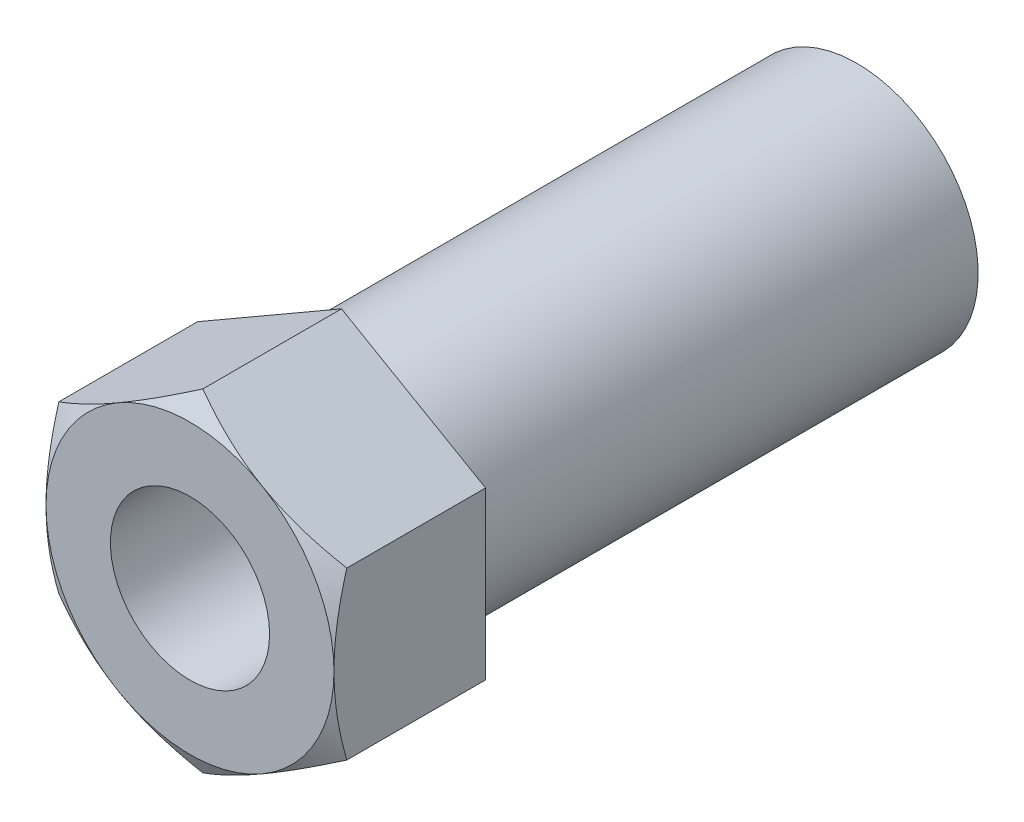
ISO-10303-21;
HEADER;
FILE_DESCRIPTION(('STEP AP214'),'2;1');
FILE_NAME('part.step','',(''),(''),'','','');
FILE_SCHEMA(('AUTOMOTIVE_DESIGN { 1 0 10303 214 1 1 1 1 }'));
ENDSEC;
DATA;
#1=APPLICATION_CONTEXT('core data for automotive mechanical design processes');
#2=APPLICATION_PROTOCOL_DEFINITION('international standard','automotive_design',2000,#1);
#3=PRODUCT_CONTEXT('',#1,'mechanical');
#4=PRODUCT('Part','Part','',(#3));
#5=PRODUCT_RELATED_PRODUCT_CATEGORY('part','',(#4));
#6=PRODUCT_DEFINITION_FORMATION('','',#4);
#7=PRODUCT_DEFINITION_CONTEXT('part definition',#1,'design');
#8=PRODUCT_DEFINITION('design','',#6,#7);
#9=PRODUCT_DEFINITION_SHAPE('','',#8);
#10=(LENGTH_UNIT() NAMED_UNIT(*) SI_UNIT(.MILLI.,.METRE.));
#11=(NAMED_UNIT(*) PLANE_ANGLE_UNIT() SI_UNIT($,.RADIAN.));
#12=(NAMED_UNIT(*) SI_UNIT($,.STERADIAN.) SOLID_ANGLE_UNIT());
#13=UNCERTAINTY_MEASURE_WITH_UNIT(LENGTH_MEASURE(1.E-05),#10,'distance_accuracy_value','');
#14=(GEOMETRIC_REPRESENTATION_CONTEXT(3) GLOBAL_UNCERTAINTY_ASSIGNED_CONTEXT((#13)) GLOBAL_UNIT_ASSIGNED_CONTEXT((#10,
#11,#12)) REPRESENTATION_CONTEXT('',''));
#15=CARTESIAN_POINT('',(0.,0.,0.));
#16=DIRECTION('',(0.,0.,1.));
#17=DIRECTION('',(1.,0.,0.));
#18=AXIS2_PLACEMENT_3D('',#15,#16,#17);
#19=CARTESIAN_POINT('',(9.5,5.48482755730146,-44.));
#20=DIRECTION('',(0.5,0.866025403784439,0.));
#21=DIRECTION('',(-0.866025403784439,0.5,0.));
#22=AXIS2_PLACEMENT_3D('',#19,#20,#21);
#23=PLANE('',#22);
#24=DIRECTION('',(0.,0.,1.));
#25=VECTOR('',#24,1.);
#26=CARTESIAN_POINT('',(9.5,5.48482755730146,-44.));
#27=LINE('',#26,#25);
#28=CARTESIAN_POINT('',(9.5,5.48482755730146,-9.99999999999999));
#29=VERTEX_POINT('',#28);
#30=CARTESIAN_POINT('',(9.5,5.48482755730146,-0.848505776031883));
#31=VERTEX_POINT('',#30);
#32=EDGE_CURVE('E429',#29,#31,#27,.T.);
#33=ORIENTED_EDGE('',*,*,#32,.F.);
#34=DIRECTION('',(-0.866025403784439,0.5,0.));
#35=VECTOR('',#34,1.);
#36=CARTESIAN_POINT('',(9.5,5.48482755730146,-9.99999999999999));
#37=LINE('',#36,#35);
#38=CARTESIAN_POINT('',(0.,10.9696551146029,-9.99999999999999));
#39=VERTEX_POINT('',#38);
#40=EDGE_CURVE('E418',#29,#39,#37,.T.);
#41=ORIENTED_EDGE('',*,*,#40,.T.);
#42=DIRECTION('',(0.,0.,1.));
#43=VECTOR('',#42,1.);
#44=CARTESIAN_POINT('',(0.,10.9696551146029,-44.));
#45=LINE('',#44,#43);
#46=CARTESIAN_POINT('',(0.,10.9696551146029,-0.848505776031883));
#47=VERTEX_POINT('',#46);
#48=EDGE_CURVE('E426',#39,#47,#45,.T.);
#49=ORIENTED_EDGE('',*,*,#48,.T.);
#50=CARTESIAN_POINT('',(9.5002,5.48471208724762,-0.848572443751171));
#51=CARTESIAN_POINT('',(9.2913692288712,5.60528058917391,-0.778973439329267));
#52=CARTESIAN_POINT('',(9.08175982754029,5.72629863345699,-0.712533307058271));
#53=CARTESIAN_POINT('',(8.66086011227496,5.96930519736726,-0.586847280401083));
#54=CARTESIAN_POINT('',(8.44956926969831,6.09129402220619,-0.527603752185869));
#55=CARTESIAN_POINT('',(7.81229220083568,6.45922610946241,-0.361814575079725));
#56=CARTESIAN_POINT('',(7.38379023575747,6.7066218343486,-0.267514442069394));
#57=CARTESIAN_POINT('',(6.74255666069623,7.07683821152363,-0.156938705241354));
#58=CARTESIAN_POINT('',(6.53174078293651,7.19855281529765,-0.125439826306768));
#59=CARTESIAN_POINT('',(6.10913296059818,7.44254555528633,-0.0726182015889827));
#60=CARTESIAN_POINT('',(5.89734099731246,7.56482370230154,-0.0512956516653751));
#61=CARTESIAN_POINT('',(5.47340378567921,7.8095839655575,-0.0193730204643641));
#62=CARTESIAN_POINT('',(5.26125925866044,7.93206566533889,-0.00876019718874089));
#63=CARTESIAN_POINT('',(4.83677424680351,8.17714220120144,0.00151746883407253));
#64=CARTESIAN_POINT('',(4.62443376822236,8.29973703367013,0.0011826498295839));
#65=CARTESIAN_POINT('',(4.22745800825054,8.52893109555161,-0.00967336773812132));
#66=CARTESIAN_POINT('',(4.04279470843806,8.63554650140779,-0.0188702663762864));
#67=CARTESIAN_POINT('',(3.67389999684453,8.84852796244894,-0.0453653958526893));
#68=CARTESIAN_POINT('',(3.48966861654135,8.95489399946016,-0.0626641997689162));
#69=CARTESIAN_POINT('',(2.937688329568,9.2735799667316,-0.126304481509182));
#70=CARTESIAN_POINT('',(2.57091646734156,9.48533580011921,-0.184381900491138));
#71=CARTESIAN_POINT('',(1.83348217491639,9.91109368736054,-0.329576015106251));
#72=CARTESIAN_POINT('',(1.46291385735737,10.1250414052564,-0.417308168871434));
#73=CARTESIAN_POINT('',(0.72730328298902,10.5497463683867,-0.616423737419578));
#74=CARTESIAN_POINT('',(0.362251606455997,10.7605090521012,-0.727760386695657));
#75=CARTESIAN_POINT('',(-0.000199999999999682,10.9697705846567,-0.84857244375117));
#76=B_SPLINE_CURVE_WITH_KNOTS('',3,(#50,#51,#52,#53,#54,#55,#56,#57,#58,#59,#60,#61,#62,#63,#64,
#65,#66,#67,#68,#69,#70,#71,#72,#73,#74,#75),.UNSPECIFIED.,.F.,.F.,(4,2,2,2,2,2,2,2,2,2,2,2,4),
(0.,0.752880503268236,1.50600787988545,3.0154687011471,3.75167336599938,4.48789219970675,
5.22323407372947,5.95855322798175,6.59868084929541,7.23885375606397,8.52010929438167,
9.82978009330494,11.1368800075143),.UNSPECIFIED.);
#77=CARTESIAN_POINT('',(4.75,8.22724133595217,0.));
#78=VERTEX_POINT('',#77);
#79=EDGE_CURVE('E537',#78,#47,#76,.T.);
#80=ORIENTED_EDGE('',*,*,#79,.F.);
#81=EDGE_CURVE('E483',#31,#78,#76,.T.);
#82=ORIENTED_EDGE('',*,*,#81,.F.);
#83=EDGE_LOOP('',(#33,#41,#49,#80,#82));
#84=FACE_BOUND('',#83,.T.);
#85=ADVANCED_FACE('F348',(#84),#23,.T.);
#86=CARTESIAN_POINT('',(9.5,-5.48482755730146,-44.));
#87=DIRECTION('',(1.,0.,0.));
#88=DIRECTION('',(0.,0.,-1.));
#89=AXIS2_PLACEMENT_3D('',#86,#87,#88);
#90=PLANE('',#89);
#91=DIRECTION('',(0.,0.,1.));
#92=VECTOR('',#91,1.);
#93=CARTESIAN_POINT('',(9.5,-5.48482755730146,-44.));
#94=LINE('',#93,#92);
#95=CARTESIAN_POINT('',(9.5,-5.48482755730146,-9.99999999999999));
#96=VERTEX_POINT('',#95);
#97=CARTESIAN_POINT('',(9.5,-5.48482755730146,-0.848505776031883));
#98=VERTEX_POINT('',#97);
#99=EDGE_CURVE('E457',#96,#98,#94,.T.);
#100=ORIENTED_EDGE('',*,*,#99,.F.);
#101=DIRECTION('',(0.,1.,0.));
#102=VECTOR('',#101,1.);
#103=CARTESIAN_POINT('',(9.5,-5.48482755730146,-9.99999999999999));
#104=LINE('',#103,#102);
#105=EDGE_CURVE('E431',#96,#29,#104,.T.);
#106=ORIENTED_EDGE('',*,*,#105,.T.);
#107=ORIENTED_EDGE('',*,*,#32,.T.);
#108=CARTESIAN_POINT('',(9.5,-14.8119713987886,-4.67464251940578));
#109=CARTESIAN_POINT('',(9.5,-14.6040441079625,-4.57359549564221));
#110=CARTESIAN_POINT('',(9.5,-14.3958747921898,-4.47304672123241));
#111=CARTESIAN_POINT('',(9.5,-13.9790016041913,-4.27305844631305));
#112=CARTESIAN_POINT('',(9.5,-13.7702977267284,-4.17361895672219));
#113=CARTESIAN_POINT('',(9.5,-13.1432537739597,-3.8771077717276));
#114=CARTESIAN_POINT('',(9.5,-12.724041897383,-3.68187285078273));
#115=CARTESIAN_POINT('',(9.5,-11.8805959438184,-3.29643571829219));
#116=CARTESIAN_POINT('',(9.5,-11.45634700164,-3.10626595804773));
#117=CARTESIAN_POINT('',(9.5,-10.6044998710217,-2.73360960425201));
#118=CARTESIAN_POINT('',(9.5,-10.1769018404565,-2.55112265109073));
#119=CARTESIAN_POINT('',(9.5,-9.30413897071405,-2.19026779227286));
#120=CARTESIAN_POINT('',(9.5,-8.85884497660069,-2.01221056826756));
#121=CARTESIAN_POINT('',(9.5,-7.96307952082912,-1.66938163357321));
#122=CARTESIAN_POINT('',(9.5,-7.51260748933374,-1.5046114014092));
#123=CARTESIAN_POINT('',(9.5,-6.60657855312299,-1.19262064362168));
#124=CARTESIAN_POINT('',(9.5,-6.15103372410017,-1.0453654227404));
#125=CARTESIAN_POINT('',(9.5,-5.23342980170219,-0.773073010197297));
#126=CARTESIAN_POINT('',(9.5,-4.77137278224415,-0.648028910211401));
#127=CARTESIAN_POINT('',(9.5,-3.84270558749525,-0.426710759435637));
#128=CARTESIAN_POINT('',(9.5,-3.37613026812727,-0.330294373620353));
#129=CARTESIAN_POINT('',(9.5,-2.67195905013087,-0.21133762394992));
#130=CARTESIAN_POINT('',(9.5,-2.43650215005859,-0.175961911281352));
#131=CARTESIAN_POINT('',(9.5,-1.96439237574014,-0.114458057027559));
#132=CARTESIAN_POINT('',(9.5,-1.72773962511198,-0.0883289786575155));
#133=CARTESIAN_POINT('',(9.5,-1.2566706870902,-0.0461697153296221));
#134=CARTESIAN_POINT('',(9.5,-1.02226603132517,-0.0300112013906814));
#135=CARTESIAN_POINT('',(9.5,-0.552983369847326,-0.00762536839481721));
#136=CARTESIAN_POINT('',(9.5,-0.318105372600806,-0.00139787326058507));
#137=CARTESIAN_POINT('',(9.5,0.151710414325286,0.000977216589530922));
#138=CARTESIAN_POINT('',(9.5,0.386648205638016,-0.00287550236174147));
#139=CARTESIAN_POINT('',(9.5,0.856154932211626,-0.0205666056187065));
#140=CARTESIAN_POINT('',(9.5,1.0907238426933,-0.0344056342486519));
#141=CARTESIAN_POINT('',(9.5,1.65160690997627,-0.0791404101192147));
#142=CARTESIAN_POINT('',(9.5,1.9775624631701,-0.114614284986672));
#143=CARTESIAN_POINT('',(9.5,2.6271547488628,-0.202941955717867));
#144=CARTESIAN_POINT('',(9.5,2.9507908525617,-0.255800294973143));
#145=CARTESIAN_POINT('',(9.5,3.59541240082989,-0.377026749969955));
#146=CARTESIAN_POINT('',(9.5,3.91639525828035,-0.445408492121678));
#147=CARTESIAN_POINT('',(9.5,4.55514687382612,-0.595584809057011));
#148=CARTESIAN_POINT('',(9.5,4.87291592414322,-0.677378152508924));
#149=CARTESIAN_POINT('',(9.5,5.51320285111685,-0.854585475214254));
#150=CARTESIAN_POINT('',(9.5,5.83563984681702,-0.950289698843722));
#151=CARTESIAN_POINT('',(9.5,6.47714039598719,-1.15171100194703));
#152=CARTESIAN_POINT('',(9.5,6.79620583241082,-1.25742212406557));
#153=CARTESIAN_POINT('',(9.5,7.43140263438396,-1.47723890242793));
#154=CARTESIAN_POINT('',(9.5,7.74753414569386,-1.59134413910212));
#155=CARTESIAN_POINT('',(9.5,8.21977674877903,-1.76776624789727));
#156=CARTESIAN_POINT('',(9.5,8.3768771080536,-1.82745575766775));
#157=CARTESIAN_POINT('',(9.5,8.69045766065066,-1.94844118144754));
#158=CARTESIAN_POINT('',(9.5,8.84693785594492,-2.00973709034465));
#159=CARTESIAN_POINT('',(9.5,9.37238948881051,-2.21841310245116));
#160=CARTESIAN_POINT('',(9.5,9.74002809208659,-2.36915607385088));
#161=CARTESIAN_POINT('',(9.5,10.4725140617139,-2.67729383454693));
#162=CARTESIAN_POINT('',(9.5,10.8373612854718,-2.83468896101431));
#163=CARTESIAN_POINT('',(9.5,11.5647155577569,-3.1549507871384));
#164=CARTESIAN_POINT('',(9.5,11.9272221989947,-3.31781841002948));
#165=CARTESIAN_POINT('',(9.5,12.6501853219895,-3.64804951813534));
#166=CARTESIAN_POINT('',(9.5,13.0106417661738,-3.81541308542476));
#167=CARTESIAN_POINT('',(9.5,13.7300101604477,-4.15397846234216));
#168=CARTESIAN_POINT('',(9.5,14.0889210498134,-4.32518252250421));
#169=CARTESIAN_POINT('',(9.5,14.8052288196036,-4.67073186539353));
#170=CARTESIAN_POINT('',(9.5,15.1626256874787,-4.84507717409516));
#171=CARTESIAN_POINT('',(9.5,16.2327933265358,-5.37203331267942));
#172=CARTESIAN_POINT('',(9.5,16.943616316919,-5.72860000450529));
#173=CARTESIAN_POINT('',(9.5,18.3630405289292,-6.45025108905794));
#174=CARTESIAN_POINT('',(9.5,19.0716324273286,-6.81535374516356));
#175=CARTESIAN_POINT('',(9.5,20.4858204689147,-7.55134236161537));
#176=CARTESIAN_POINT('',(9.5,21.1914165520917,-7.9222284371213));
#177=CARTESIAN_POINT('',(9.5,22.5999984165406,-8.66828108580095));
#178=CARTESIAN_POINT('',(9.5,23.3029850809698,-9.0434459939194));
#179=CARTESIAN_POINT('',(9.5,24.7070954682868,-9.79723174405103));
#180=CARTESIAN_POINT('',(9.5,25.4082192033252,-10.1758525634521));
#181=CARTESIAN_POINT('',(9.5,27.3043063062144,-11.2045618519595));
#182=CARTESIAN_POINT('',(9.5,28.4978494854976,-11.8572669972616));
#183=CARTESIAN_POINT('',(9.5,30.8820105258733,-13.1682987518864));
#184=CARTESIAN_POINT('',(9.5,32.0726280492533,-13.8266259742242));
#185=CARTESIAN_POINT('',(9.5,34.4465595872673,-15.1445181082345));
#186=CARTESIAN_POINT('',(9.5,35.6298831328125,-15.8040658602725));
#187=CARTESIAN_POINT('',(9.5,37.4035349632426,-16.7956031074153));
#188=CARTESIAN_POINT('',(9.5,37.9944943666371,-17.1264647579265));
#189=CARTESIAN_POINT('',(9.5,39.1760411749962,-17.7888506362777));
#190=CARTESIAN_POINT('',(9.5,39.766628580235,-18.1203748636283));
#191=CARTESIAN_POINT('',(9.5,40.3570547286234,-18.452186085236));
#192=B_SPLINE_CURVE_WITH_KNOTS('',3,(#108,#109,#110,#111,#112,#113,#114,#115,#116,#117,#118,
#119,#120,#121,#122,#123,#124,#125,#126,#127,#128,#129,#130,#131,#132,#133,#134,#135,#136,#137,
#138,#139,#140,#141,#142,#143,#144,#145,#146,#147,#148,#149,#150,#151,#152,#153,#154,#155,#156,
#157,#158,#159,#160,#161,#162,#163,#164,#165,#166,#167,#168,#169,#170,#171,#172,#173,#174,#175,
#176,#177,#178,#179,#180,#181,#182,#183,#184,#185,#186,#187,#188,#189,#190,#191),.UNSPECIFIED.,
.F.,.F.,(4,2,2,2,2,2,2,2,2,2,2,2,2,2,2,2,2,2,2,2,2,2,2,2,2,2,2,2,2,2,2,2,2,2,2,2,2,2,2,2,2,4),
(0.,0.693539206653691,1.38708523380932,2.77437924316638,4.16908323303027,5.56372186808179,
7.0022790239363,8.44099603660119,9.8768138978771,11.3121843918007,12.7402939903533,
13.4544396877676,14.1685130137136,14.8731927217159,15.5778599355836,16.2825490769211,
16.9872836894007,17.9703836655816,18.9537407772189,19.9379644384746,20.922097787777,
21.9309222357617,22.9391498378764,23.9473270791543,24.4514927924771,24.9556569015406,
26.1475951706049,27.339593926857,28.5317947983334,29.7240174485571,30.9169580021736,
32.1099084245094,34.4955596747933,36.8868926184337,39.278273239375,41.6687530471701,
44.0592172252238,48.1402621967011,52.2217579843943,56.285902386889,58.3177293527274,
60.3495548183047),.UNSPECIFIED.);
#193=CARTESIAN_POINT('',(9.5,0.,0.));
#194=VERTEX_POINT('',#193);
#195=EDGE_CURVE('E489',#194,#31,#192,.T.);
#196=ORIENTED_EDGE('',*,*,#195,.F.);
#197=EDGE_CURVE('E491',#98,#194,#192,.T.);
#198=ORIENTED_EDGE('',*,*,#197,.F.);
#199=EDGE_LOOP('',(#100,#106,#107,#196,#198));
#200=FACE_BOUND('',#199,.T.);
#201=ADVANCED_FACE('F508',(#200),#90,.T.);
#202=CARTESIAN_POINT('',(9.5,-5.48482755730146,-44.));
#203=DIRECTION('',(0.5,-0.866025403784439,0.));
#204=DIRECTION('',(0.866025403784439,0.5,0.));
#205=AXIS2_PLACEMENT_3D('',#202,#203,#204);
#206=PLANE('',#205);
#207=DIRECTION('',(0.,0.,1.));
#208=VECTOR('',#207,1.);
#209=CARTESIAN_POINT('',(0.,-10.9696551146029,-44.));
#210=LINE('',#209,#208);
#211=CARTESIAN_POINT('',(0.,-10.9696551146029,-9.99999999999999));
#212=VERTEX_POINT('',#211);
#213=CARTESIAN_POINT('',(0.,-10.9696551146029,-0.848505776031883));
#214=VERTEX_POINT('',#213);
#215=EDGE_CURVE('E462',#212,#214,#210,.T.);
#216=ORIENTED_EDGE('',*,*,#215,.F.);
#217=DIRECTION('',(0.866025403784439,0.5,0.));
#218=VECTOR('',#217,1.);
#219=CARTESIAN_POINT('',(9.5,-5.48482755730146,-9.99999999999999));
#220=LINE('',#219,#218);
#221=EDGE_CURVE('E551',#212,#96,#220,.T.);
#222=ORIENTED_EDGE('',*,*,#221,.T.);
#223=ORIENTED_EDGE('',*,*,#99,.T.);
#224=CARTESIAN_POINT('',(-0.0002,-10.9697705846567,-0.848572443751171));
#225=CARTESIAN_POINT('',(0.2086307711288,-10.8492020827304,-0.778973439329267));
#226=CARTESIAN_POINT('',(0.418240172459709,-10.7281840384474,-0.712533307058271));
#227=CARTESIAN_POINT('',(0.839139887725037,-10.4851774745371,-0.586847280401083));
#228=CARTESIAN_POINT('',(1.05043073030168,-10.3631886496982,-0.527603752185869));
#229=CARTESIAN_POINT('',(1.68770779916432,-9.99525656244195,-0.361814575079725));
#230=CARTESIAN_POINT('',(2.11620976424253,-9.74786083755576,-0.267514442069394));
#231=CARTESIAN_POINT('',(2.75744333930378,-9.37764446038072,-0.156938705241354));
#232=CARTESIAN_POINT('',(2.96825921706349,-9.25592985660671,-0.125439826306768));
#233=CARTESIAN_POINT('',(3.39086703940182,-9.01193711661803,-0.0726182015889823));
#234=CARTESIAN_POINT('',(3.60265900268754,-8.88965896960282,-0.0512956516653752));
#235=CARTESIAN_POINT('',(4.0265962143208,-8.64489870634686,-0.0193730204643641));
#236=CARTESIAN_POINT('',(4.23874074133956,-8.52241700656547,-0.00876019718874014));
#237=CARTESIAN_POINT('',(4.66322575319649,-8.27734047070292,0.00151746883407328));
#238=CARTESIAN_POINT('',(4.87556623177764,-8.15474563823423,0.00118264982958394));
#239=CARTESIAN_POINT('',(5.27254199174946,-7.92555157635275,-0.00967336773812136));
#240=CARTESIAN_POINT('',(5.45720529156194,-7.81893617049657,-0.018870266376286));
#241=CARTESIAN_POINT('',(5.82610000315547,-7.60595470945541,-0.045365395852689));
#242=CARTESIAN_POINT('',(6.01033138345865,-7.4995886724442,-0.0626641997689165));
#243=CARTESIAN_POINT('',(6.56231167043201,-7.18090270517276,-0.126304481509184));
#244=CARTESIAN_POINT('',(6.92908353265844,-6.96914687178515,-0.184381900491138));
#245=CARTESIAN_POINT('',(7.66651782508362,-6.54338898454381,-0.329576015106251));
#246=CARTESIAN_POINT('',(8.03708614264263,-6.32944126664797,-0.417308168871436));
#247=CARTESIAN_POINT('',(8.77269671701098,-5.90473630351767,-0.616423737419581));
#248=CARTESIAN_POINT('',(9.13774839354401,-5.6939736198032,-0.727760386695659));
#249=CARTESIAN_POINT('',(9.5002,-5.48471208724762,-0.84857244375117));
#250=B_SPLINE_CURVE_WITH_KNOTS('',3,(#224,#225,#226,#227,#228,#229,#230,#231,#232,#233,#234,
#235,#236,#237,#238,#239,#240,#241,#242,#243,#244,#245,#246,#247,#248,#249),.UNSPECIFIED.,.F.,
.F.,(4,2,2,2,2,2,2,2,2,2,2,2,4),(0.,0.752880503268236,1.50600787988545,3.0154687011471,
3.75167336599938,4.48789219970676,5.22323407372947,5.95855322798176,6.59868084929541,
7.23885375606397,8.52010929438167,9.82978009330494,11.1368800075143),.UNSPECIFIED.);
#251=CARTESIAN_POINT('',(4.75,-8.22724133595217,0.));
#252=VERTEX_POINT('',#251);
#253=EDGE_CURVE('E443',#252,#98,#250,.T.);
#254=ORIENTED_EDGE('',*,*,#253,.F.);
#255=EDGE_CURVE('E439',#214,#252,#250,.T.);
#256=ORIENTED_EDGE('',*,*,#255,.F.);
#257=EDGE_LOOP('',(#216,#222,#223,#254,#256));
#258=FACE_BOUND('',#257,.T.);
#259=ADVANCED_FACE('F577',(#258),#206,.T.);
#260=CARTESIAN_POINT('',(-9.5,-5.48482755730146,-44.));
#261=DIRECTION('',(-0.5,-0.866025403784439,0.));
#262=DIRECTION('',(0.866025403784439,-0.5,0.));
#263=AXIS2_PLACEMENT_3D('',#260,#261,#262);
#264=PLANE('',#263);
#265=DIRECTION('',(0.,0.,1.));
#266=VECTOR('',#265,1.);
#267=CARTESIAN_POINT('',(-9.5,-5.48482755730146,-44.));
#268=LINE('',#267,#266);
#269=CARTESIAN_POINT('',(-9.5,-5.48482755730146,-9.99999999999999));
#270=VERTEX_POINT('',#269);
#271=CARTESIAN_POINT('',(-9.5,-5.48482755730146,-0.848505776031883));
#272=VERTEX_POINT('',#271);
#273=EDGE_CURVE('E441',#270,#272,#268,.T.);
#274=ORIENTED_EDGE('',*,*,#273,.F.);
#275=DIRECTION('',(0.866025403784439,-0.5,0.));
#276=VECTOR('',#275,1.);
#277=CARTESIAN_POINT('',(-9.5,-5.48482755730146,-9.99999999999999));
#278=LINE('',#277,#276);
#279=EDGE_CURVE('E554',#270,#212,#278,.T.);
#280=ORIENTED_EDGE('',*,*,#279,.T.);
#281=ORIENTED_EDGE('',*,*,#215,.T.);
#282=CARTESIAN_POINT('',(-9.5002,-5.48471208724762,-0.848572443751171));
#283=CARTESIAN_POINT('',(-9.2913692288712,-5.60528058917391,-0.778973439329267));
#284=CARTESIAN_POINT('',(-9.08175982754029,-5.72629863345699,-0.712533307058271));
#285=CARTESIAN_POINT('',(-8.66086011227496,-5.96930519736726,-0.586847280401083));
#286=CARTESIAN_POINT('',(-8.44956926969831,-6.09129402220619,-0.527603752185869));
#287=CARTESIAN_POINT('',(-7.81229220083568,-6.45922610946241,-0.361814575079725));
#288=CARTESIAN_POINT('',(-7.38379023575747,-6.7066218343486,-0.267514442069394));
#289=CARTESIAN_POINT('',(-6.74255666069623,-7.07683821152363,-0.156938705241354));
#290=CARTESIAN_POINT('',(-6.53174078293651,-7.19855281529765,-0.125439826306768));
#291=CARTESIAN_POINT('',(-6.10913296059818,-7.44254555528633,-0.0726182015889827));
#292=CARTESIAN_POINT('',(-5.89734099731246,-7.56482370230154,-0.0512956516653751));
#293=CARTESIAN_POINT('',(-5.47340378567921,-7.8095839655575,-0.0193730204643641));
#294=CARTESIAN_POINT('',(-5.26125925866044,-7.93206566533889,-0.00876019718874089));
#295=CARTESIAN_POINT('',(-4.83677424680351,-8.17714220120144,0.00151746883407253));
#296=CARTESIAN_POINT('',(-4.62443376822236,-8.29973703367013,0.0011826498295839));
#297=CARTESIAN_POINT('',(-4.22745800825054,-8.52893109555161,-0.00967336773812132));
#298=CARTESIAN_POINT('',(-4.04279470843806,-8.63554650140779,-0.0188702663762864));
#299=CARTESIAN_POINT('',(-3.67389999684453,-8.84852796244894,-0.0453653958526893));
#300=CARTESIAN_POINT('',(-3.48966861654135,-8.95489399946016,-0.0626641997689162));
#301=CARTESIAN_POINT('',(-2.937688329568,-9.2735799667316,-0.126304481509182));
#302=CARTESIAN_POINT('',(-2.57091646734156,-9.48533580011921,-0.184381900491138));
#303=CARTESIAN_POINT('',(-1.83348217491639,-9.91109368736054,-0.329576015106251));
#304=CARTESIAN_POINT('',(-1.46291385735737,-10.1250414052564,-0.417308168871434));
#305=CARTESIAN_POINT('',(-0.72730328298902,-10.5497463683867,-0.616423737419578));
#306=CARTESIAN_POINT('',(-0.362251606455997,-10.7605090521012,-0.727760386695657));
#307=CARTESIAN_POINT('',(0.000199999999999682,-10.9697705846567,-0.84857244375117));
#308=B_SPLINE_CURVE_WITH_KNOTS('',3,(#282,#283,#284,#285,#286,#287,#288,#289,#290,#291,#292,
#293,#294,#295,#296,#297,#298,#299,#300,#301,#302,#303,#304,#305,#306,#307),.UNSPECIFIED.,.F.,
.F.,(4,2,2,2,2,2,2,2,2,2,2,2,4),(0.,0.752880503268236,1.50600787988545,3.0154687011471,
3.75167336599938,4.48789219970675,5.22323407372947,5.95855322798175,6.59868084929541,
7.23885375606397,8.52010929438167,9.82978009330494,11.1368800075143),.UNSPECIFIED.);
#309=CARTESIAN_POINT('',(-4.75,-8.22724133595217,0.));
#310=VERTEX_POINT('',#309);
#311=EDGE_CURVE('E488',#310,#214,#308,.T.);
#312=ORIENTED_EDGE('',*,*,#311,.F.);
#313=EDGE_CURVE('E481',#272,#310,#308,.T.);
#314=ORIENTED_EDGE('',*,*,#313,.F.);
#315=EDGE_LOOP('',(#274,#280,#281,#312,#314));
#316=FACE_BOUND('',#315,.T.);
#317=ADVANCED_FACE('F486',(#316),#264,.T.);
#318=CARTESIAN_POINT('',(-9.5,-5.48482755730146,-44.));
#319=DIRECTION('',(-1.,0.,0.));
#320=DIRECTION('',(0.,0.,1.));
#321=AXIS2_PLACEMENT_3D('',#318,#319,#320);
#322=PLANE('',#321);
#323=DIRECTION('',(0.,0.,1.));
#324=VECTOR('',#323,1.);
#325=CARTESIAN_POINT('',(-9.5,5.48482755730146,-44.));
#326=LINE('',#325,#324);
#327=CARTESIAN_POINT('',(-9.5,5.48482755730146,-9.99999999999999));
#328=VERTEX_POINT('',#327);
#329=CARTESIAN_POINT('',(-9.5,5.48482755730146,-0.848505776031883));
#330=VERTEX_POINT('',#329);
#331=EDGE_CURVE('E438',#328,#330,#326,.T.);
#332=ORIENTED_EDGE('',*,*,#331,.F.);
#333=DIRECTION('',(0.,-1.,0.));
#334=VECTOR('',#333,1.);
#335=CARTESIAN_POINT('',(-9.5,-5.48482755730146,-9.99999999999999));
#336=LINE('',#335,#334);
#337=EDGE_CURVE('E363',#328,#270,#336,.T.);
#338=ORIENTED_EDGE('',*,*,#337,.T.);
#339=ORIENTED_EDGE('',*,*,#273,.T.);
#340=CARTESIAN_POINT('',(-9.5,-14.8119713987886,-4.67464251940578));
#341=CARTESIAN_POINT('',(-9.5,-14.6040441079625,-4.57359549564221));
#342=CARTESIAN_POINT('',(-9.5,-14.3958747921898,-4.47304672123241));
#343=CARTESIAN_POINT('',(-9.5,-13.9790016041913,-4.27305844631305));
#344=CARTESIAN_POINT('',(-9.5,-13.7702977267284,-4.17361895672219));
#345=CARTESIAN_POINT('',(-9.5,-13.1432537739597,-3.8771077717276));
#346=CARTESIAN_POINT('',(-9.5,-12.724041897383,-3.68187285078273));
#347=CARTESIAN_POINT('',(-9.5,-11.8805959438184,-3.29643571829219));
#348=CARTESIAN_POINT('',(-9.5,-11.45634700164,-3.10626595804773));
#349=CARTESIAN_POINT('',(-9.5,-10.6044998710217,-2.73360960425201));
#350=CARTESIAN_POINT('',(-9.5,-10.1769018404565,-2.55112265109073));
#351=CARTESIAN_POINT('',(-9.5,-9.30413897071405,-2.19026779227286));
#352=CARTESIAN_POINT('',(-9.5,-8.85884497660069,-2.01221056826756));
#353=CARTESIAN_POINT('',(-9.5,-7.96307952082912,-1.66938163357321));
#354=CARTESIAN_POINT('',(-9.5,-7.51260748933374,-1.5046114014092));
#355=CARTESIAN_POINT('',(-9.5,-6.60657855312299,-1.19262064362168));
#356=CARTESIAN_POINT('',(-9.5,-6.15103372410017,-1.0453654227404));
#357=CARTESIAN_POINT('',(-9.5,-5.23342980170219,-0.773073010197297));
#358=CARTESIAN_POINT('',(-9.5,-4.77137278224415,-0.648028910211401));
#359=CARTESIAN_POINT('',(-9.5,-3.84270558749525,-0.426710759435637));
#360=CARTESIAN_POINT('',(-9.5,-3.37613026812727,-0.330294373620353));
#361=CARTESIAN_POINT('',(-9.5,-2.67195905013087,-0.21133762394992));
#362=CARTESIAN_POINT('',(-9.5,-2.43650215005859,-0.175961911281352));
#363=CARTESIAN_POINT('',(-9.5,-1.96439237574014,-0.114458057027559));
#364=CARTESIAN_POINT('',(-9.5,-1.72773962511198,-0.0883289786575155));
#365=CARTESIAN_POINT('',(-9.5,-1.2566706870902,-0.0461697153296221));
#366=CARTESIAN_POINT('',(-9.5,-1.02226603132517,-0.0300112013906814));
#367=CARTESIAN_POINT('',(-9.5,-0.552983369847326,-0.00762536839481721));
#368=CARTESIAN_POINT('',(-9.5,-0.318105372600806,-0.00139787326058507));
#369=CARTESIAN_POINT('',(-9.5,0.151710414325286,0.000977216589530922));
#370=CARTESIAN_POINT('',(-9.5,0.386648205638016,-0.00287550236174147));
#371=CARTESIAN_POINT('',(-9.5,0.856154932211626,-0.0205666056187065));
#372=CARTESIAN_POINT('',(-9.5,1.0907238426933,-0.0344056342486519));
#373=CARTESIAN_POINT('',(-9.5,1.65160690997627,-0.0791404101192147));
#374=CARTESIAN_POINT('',(-9.5,1.9775624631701,-0.114614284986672));
#375=CARTESIAN_POINT('',(-9.5,2.6271547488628,-0.202941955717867));
#376=CARTESIAN_POINT('',(-9.5,2.9507908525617,-0.255800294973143));
#377=CARTESIAN_POINT('',(-9.5,3.59541240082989,-0.377026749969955));
#378=CARTESIAN_POINT('',(-9.5,3.91639525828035,-0.445408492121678));
#379=CARTESIAN_POINT('',(-9.5,4.55514687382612,-0.595584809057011));
#380=CARTESIAN_POINT('',(-9.5,4.87291592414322,-0.677378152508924));
#381=CARTESIAN_POINT('',(-9.5,5.51320285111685,-0.854585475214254));
#382=CARTESIAN_POINT('',(-9.5,5.83563984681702,-0.950289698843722));
#383=CARTESIAN_POINT('',(-9.5,6.47714039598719,-1.15171100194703));
#384=CARTESIAN_POINT('',(-9.5,6.79620583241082,-1.25742212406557));
#385=CARTESIAN_POINT('',(-9.5,7.43140263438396,-1.47723890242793));
#386=CARTESIAN_POINT('',(-9.5,7.74753414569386,-1.59134413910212));
#387=CARTESIAN_POINT('',(-9.5,8.21977674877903,-1.76776624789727));
#388=CARTESIAN_POINT('',(-9.5,8.3768771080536,-1.82745575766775));
#389=CARTESIAN_POINT('',(-9.5,8.69045766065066,-1.94844118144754));
#390=CARTESIAN_POINT('',(-9.5,8.84693785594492,-2.00973709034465));
#391=CARTESIAN_POINT('',(-9.5,9.37238948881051,-2.21841310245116));
#392=CARTESIAN_POINT('',(-9.5,9.74002809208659,-2.36915607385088));
#393=CARTESIAN_POINT('',(-9.5,10.4725140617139,-2.67729383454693));
#394=CARTESIAN_POINT('',(-9.5,10.8373612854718,-2.83468896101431));
#395=CARTESIAN_POINT('',(-9.5,11.5647155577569,-3.1549507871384));
#396=CARTESIAN_POINT('',(-9.5,11.9272221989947,-3.31781841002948));
#397=CARTESIAN_POINT('',(-9.5,12.6501853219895,-3.64804951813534));
#398=CARTESIAN_POINT('',(-9.5,13.0106417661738,-3.81541308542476));
#399=CARTESIAN_POINT('',(-9.5,13.7300101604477,-4.15397846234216));
#400=CARTESIAN_POINT('',(-9.5,14.0889210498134,-4.32518252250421));
#401=CARTESIAN_POINT('',(-9.5,14.8052288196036,-4.67073186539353));
#402=CARTESIAN_POINT('',(-9.5,15.1626256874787,-4.84507717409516));
#403=CARTESIAN_POINT('',(-9.5,16.2327933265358,-5.37203331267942));
#404=CARTESIAN_POINT('',(-9.5,16.943616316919,-5.72860000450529));
#405=CARTESIAN_POINT('',(-9.5,18.3630405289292,-6.45025108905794));
#406=CARTESIAN_POINT('',(-9.5,19.0716324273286,-6.81535374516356));
#407=CARTESIAN_POINT('',(-9.5,20.4858204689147,-7.55134236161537));
#408=CARTESIAN_POINT('',(-9.5,21.1914165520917,-7.9222284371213));
#409=CARTESIAN_POINT('',(-9.5,22.5999984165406,-8.66828108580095));
#410=CARTESIAN_POINT('',(-9.5,23.3029850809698,-9.0434459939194));
#411=CARTESIAN_POINT('',(-9.5,24.7070954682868,-9.79723174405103));
#412=CARTESIAN_POINT('',(-9.5,25.4082192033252,-10.1758525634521));
#413=CARTESIAN_POINT('',(-9.5,27.3043063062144,-11.2045618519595));
#414=CARTESIAN_POINT('',(-9.5,28.4978494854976,-11.8572669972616));
#415=CARTESIAN_POINT('',(-9.5,30.8820105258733,-13.1682987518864));
#416=CARTESIAN_POINT('',(-9.5,32.0726280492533,-13.8266259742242));
#417=CARTESIAN_POINT('',(-9.5,34.4465595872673,-15.1445181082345));
#418=CARTESIAN_POINT('',(-9.5,35.6298831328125,-15.8040658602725));
#419=CARTESIAN_POINT('',(-9.5,37.4035349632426,-16.7956031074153));
#420=CARTESIAN_POINT('',(-9.5,37.9944943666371,-17.1264647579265));
#421=CARTESIAN_POINT('',(-9.5,39.1760411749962,-17.7888506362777));
#422=CARTESIAN_POINT('',(-9.5,39.766628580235,-18.1203748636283));
#423=CARTESIAN_POINT('',(-9.5,40.3570547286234,-18.452186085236));
#424=B_SPLINE_CURVE_WITH_KNOTS('',3,(#340,#341,#342,#343,#344,#345,#346,#347,#348,#349,#350,
#351,#352,#353,#354,#355,#356,#357,#358,#359,#360,#361,#362,#363,#364,#365,#366,#367,#368,#369,
#370,#371,#372,#373,#374,#375,#376,#377,#378,#379,#380,#381,#382,#383,#384,#385,#386,#387,#388,
#389,#390,#391,#392,#393,#394,#395,#396,#397,#398,#399,#400,#401,#402,#403,#404,#405,#406,#407,
#408,#409,#410,#411,#412,#413,#414,#415,#416,#417,#418,#419,#420,#421,#422,#423),.UNSPECIFIED.,
.F.,.F.,(4,2,2,2,2,2,2,2,2,2,2,2,2,2,2,2,2,2,2,2,2,2,2,2,2,2,2,2,2,2,2,2,2,2,2,2,2,2,2,2,2,4),
(0.,0.693539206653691,1.38708523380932,2.77437924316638,4.16908323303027,5.56372186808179,
7.0022790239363,8.44099603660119,9.8768138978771,11.3121843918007,12.7402939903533,
13.4544396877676,14.1685130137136,14.8731927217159,15.5778599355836,16.2825490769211,
16.9872836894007,17.9703836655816,18.9537407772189,19.9379644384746,20.922097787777,
21.9309222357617,22.9391498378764,23.9473270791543,24.4514927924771,24.9556569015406,
26.1475951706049,27.339593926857,28.5317947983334,29.7240174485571,30.9169580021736,
32.1099084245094,34.4955596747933,36.8868926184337,39.278273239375,41.6687530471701,
44.0592172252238,48.1402621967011,52.2217579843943,56.285902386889,58.3177293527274,
60.3495548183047),.UNSPECIFIED.);
#425=CARTESIAN_POINT('',(-9.5,0.,0.));
#426=VERTEX_POINT('',#425);
#427=EDGE_CURVE('E476',#426,#272,#424,.F.);
#428=ORIENTED_EDGE('',*,*,#427,.F.);
#429=EDGE_CURVE('E485',#330,#426,#424,.F.);
#430=ORIENTED_EDGE('',*,*,#429,.F.);
#431=EDGE_LOOP('',(#332,#338,#339,#428,#430));
#432=FACE_BOUND('',#431,.T.);
#433=ADVANCED_FACE('F474',(#432),#322,.T.);
#434=CARTESIAN_POINT('',(-9.5,5.48482755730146,-44.));
#435=DIRECTION('',(-0.5,0.866025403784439,0.));
#436=DIRECTION('',(-0.866025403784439,-0.5,0.));
#437=AXIS2_PLACEMENT_3D('',#434,#435,#436);
#438=PLANE('',#437);
#439=ORIENTED_EDGE('',*,*,#48,.F.);
#440=DIRECTION('',(-0.866025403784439,-0.5,0.));
#441=VECTOR('',#440,1.);
#442=CARTESIAN_POINT('',(-9.5,5.48482755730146,-9.99999999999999));
#443=LINE('',#442,#441);
#444=EDGE_CURVE('E11',#39,#328,#443,.T.);
#445=ORIENTED_EDGE('',*,*,#444,.T.);
#446=ORIENTED_EDGE('',*,*,#331,.T.);
#447=CARTESIAN_POINT('',(0.0002,10.9697705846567,-0.848572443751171));
#448=CARTESIAN_POINT('',(-0.2086307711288,10.8492020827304,-0.778973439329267));
#449=CARTESIAN_POINT('',(-0.418240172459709,10.7281840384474,-0.712533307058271));
#450=CARTESIAN_POINT('',(-0.839139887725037,10.4851774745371,-0.586847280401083));
#451=CARTESIAN_POINT('',(-1.05043073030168,10.3631886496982,-0.527603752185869));
#452=CARTESIAN_POINT('',(-1.68770779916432,9.99525656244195,-0.361814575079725));
#453=CARTESIAN_POINT('',(-2.11620976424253,9.74786083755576,-0.267514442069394));
#454=CARTESIAN_POINT('',(-2.75744333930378,9.37764446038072,-0.156938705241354));
#455=CARTESIAN_POINT('',(-2.96825921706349,9.25592985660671,-0.125439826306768));
#456=CARTESIAN_POINT('',(-3.39086703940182,9.01193711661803,-0.0726182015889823));
#457=CARTESIAN_POINT('',(-3.60265900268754,8.88965896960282,-0.0512956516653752));
#458=CARTESIAN_POINT('',(-4.0265962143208,8.64489870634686,-0.0193730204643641));
#459=CARTESIAN_POINT('',(-4.23874074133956,8.52241700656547,-0.00876019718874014));
#460=CARTESIAN_POINT('',(-4.66322575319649,8.27734047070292,0.00151746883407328));
#461=CARTESIAN_POINT('',(-4.87556623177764,8.15474563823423,0.00118264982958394));
#462=CARTESIAN_POINT('',(-5.27254199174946,7.92555157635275,-0.00967336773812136));
#463=CARTESIAN_POINT('',(-5.45720529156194,7.81893617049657,-0.018870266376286));
#464=CARTESIAN_POINT('',(-5.82610000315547,7.60595470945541,-0.045365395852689));
#465=CARTESIAN_POINT('',(-6.01033138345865,7.4995886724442,-0.0626641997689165));
#466=CARTESIAN_POINT('',(-6.56231167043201,7.18090270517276,-0.126304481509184));
#467=CARTESIAN_POINT('',(-6.92908353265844,6.96914687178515,-0.184381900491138));
#468=CARTESIAN_POINT('',(-7.66651782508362,6.54338898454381,-0.329576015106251));
#469=CARTESIAN_POINT('',(-8.03708614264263,6.32944126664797,-0.417308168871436));
#470=CARTESIAN_POINT('',(-8.77269671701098,5.90473630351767,-0.616423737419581));
#471=CARTESIAN_POINT('',(-9.13774839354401,5.6939736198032,-0.727760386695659));
#472=CARTESIAN_POINT('',(-9.5002,5.48471208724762,-0.84857244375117));
#473=B_SPLINE_CURVE_WITH_KNOTS('',3,(#447,#448,#449,#450,#451,#452,#453,#454,#455,#456,#457,
#458,#459,#460,#461,#462,#463,#464,#465,#466,#467,#468,#469,#470,#471,#472),.UNSPECIFIED.,.F.,
.F.,(4,2,2,2,2,2,2,2,2,2,2,2,4),(0.,0.752880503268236,1.50600787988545,3.0154687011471,
3.75167336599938,4.48789219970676,5.22323407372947,5.95855322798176,6.59868084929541,
7.23885375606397,8.52010929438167,9.82978009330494,11.1368800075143),.UNSPECIFIED.);
#474=CARTESIAN_POINT('',(-4.75,8.22724133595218,0.));
#475=VERTEX_POINT('',#474);
#476=EDGE_CURVE('E525',#475,#330,#473,.T.);
#477=ORIENTED_EDGE('',*,*,#476,.F.);
#478=EDGE_CURVE('E437',#47,#475,#473,.T.);
#479=ORIENTED_EDGE('',*,*,#478,.F.);
#480=EDGE_LOOP('',(#439,#445,#446,#477,#479));
#481=FACE_BOUND('',#480,.T.);
#482=ADVANCED_FACE('F434',(#481),#438,.T.);
#483=CARTESIAN_POINT('',(-9.5,16.4544826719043,-44.));
#484=DIRECTION('',(0.,0.,-1.));
#485=DIRECTION('',(-1.,0.,0.));
#486=AXIS2_PLACEMENT_3D('',#483,#484,#485);
#487=PLANE('',#486);
#488=CARTESIAN_POINT('',(0.,0.,-44.));
#489=DIRECTION('',(0.,0.,1.));
#490=DIRECTION('',(1.,0.,0.));
#491=AXIS2_PLACEMENT_3D('',#488,#489,#490);
#492=CIRCLE('',#491,5.25);
#493=CARTESIAN_POINT('',(5.25,0.,-44.));
#494=VERTEX_POINT('',#493);
#495=EDGE_CURVE('E544',#494,#494,#492,.T.);
#496=ORIENTED_EDGE('',*,*,#495,.T.);
#497=EDGE_LOOP('',(#496));
#498=FACE_BOUND('',#497,.T.);
#499=CARTESIAN_POINT('',(0.,0.,-44.));
#500=DIRECTION('',(0.,0.,-1.));
#501=DIRECTION('',(-1.,0.,0.));
#502=AXIS2_PLACEMENT_3D('',#499,#500,#501);
#503=CIRCLE('',#502,8.);
#504=CARTESIAN_POINT('',(-8.,0.,-44.));
#505=VERTEX_POINT('',#504);
#506=EDGE_CURVE('E560',#505,#505,#503,.T.);
#507=ORIENTED_EDGE('',*,*,#506,.T.);
#508=EDGE_LOOP('',(#507));
#509=FACE_BOUND('',#508,.T.);
#510=ADVANCED_FACE('F564',(#498,#509),#487,.T.);
#511=CARTESIAN_POINT('',(-9.5,16.4544826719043,0.));
#512=DIRECTION('',(0.,0.,-1.));
#513=DIRECTION('',(-1.,0.,0.));
#514=AXIS2_PLACEMENT_3D('',#511,#512,#513);
#515=PLANE('',#514);
#516=CARTESIAN_POINT('',(0.,0.,0.));
#517=DIRECTION('',(0.,0.,1.));
#518=DIRECTION('',(1.,0.,0.));
#519=AXIS2_PLACEMENT_3D('',#516,#517,#518);
#520=CIRCLE('',#519,5.25);
#521=CARTESIAN_POINT('',(5.25,0.,0.));
#522=VERTEX_POINT('',#521);
#523=EDGE_CURVE('E430',#522,#522,#520,.T.);
#524=ORIENTED_EDGE('',*,*,#523,.F.);
#525=EDGE_LOOP('',(#524));
#526=FACE_BOUND('',#525,.T.);
#527=CARTESIAN_POINT('',(0.,0.,0.));
#528=DIRECTION('',(0.,0.,-1.));
#529=DIRECTION('',(-1.,0.,0.));
#530=AXIS2_PLACEMENT_3D('',#527,#528,#529);
#531=CIRCLE('',#530,9.5);
#532=EDGE_CURVE('E543',#426,#475,#531,.T.);
#533=ORIENTED_EDGE('',*,*,#532,.F.);
#534=CARTESIAN_POINT('',(0.,0.,0.));
#535=DIRECTION('',(0.,0.,-1.));
#536=DIRECTION('',(-1.,0.,0.));
#537=AXIS2_PLACEMENT_3D('',#534,#535,#536);
#538=CIRCLE('',#537,9.5);
#539=EDGE_CURVE('E356',#426,#310,#538,.F.);
#540=ORIENTED_EDGE('',*,*,#539,.T.);
#541=EDGE_CURVE('E446',#310,#252,#538,.F.);
#542=ORIENTED_EDGE('',*,*,#541,.T.);
#543=EDGE_CURVE('E452',#252,#194,#538,.F.);
#544=ORIENTED_EDGE('',*,*,#543,.T.);
#545=EDGE_CURVE('E453',#194,#78,#538,.F.);
#546=ORIENTED_EDGE('',*,*,#545,.T.);
#547=EDGE_CURVE('E447',#78,#475,#538,.F.);
#548=ORIENTED_EDGE('',*,*,#547,.T.);
#549=EDGE_LOOP('',(#533,#540,#542,#544,#546,#548));
#550=FACE_BOUND('',#549,.T.);
#551=ADVANCED_FACE('F517',(#526,#550),#515,.F.);
#552=CARTESIAN_POINT('',(0.,0.,0.));
#553=DIRECTION('',(0.,0.,-1.));
#554=DIRECTION('',(-1.,0.,0.));
#555=AXIS2_PLACEMENT_3D('',#552,#553,#554);
#556=CONICAL_SURFACE('',#555,9.5,1.0471975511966);
#557=ORIENTED_EDGE('',*,*,#429,.T.);
#558=ORIENTED_EDGE('',*,*,#532,.T.);
#559=ORIENTED_EDGE('',*,*,#476,.T.);
#560=EDGE_LOOP('',(#557,#558,#559));
#561=FACE_BOUND('',#560,.T.);
#562=ADVANCED_FACE('F511',(#561),#556,.T.);
#563=ORIENTED_EDGE('',*,*,#79,.T.);
#564=ORIENTED_EDGE('',*,*,#478,.T.);
#565=ORIENTED_EDGE('',*,*,#547,.F.);
#566=EDGE_LOOP('',(#563,#564,#565));
#567=FACE_BOUND('',#566,.T.);
#568=ADVANCED_FACE('F516',(#567),#556,.T.);
#569=ORIENTED_EDGE('',*,*,#195,.T.);
#570=ORIENTED_EDGE('',*,*,#81,.T.);
#571=ORIENTED_EDGE('',*,*,#545,.F.);
#572=EDGE_LOOP('',(#569,#570,#571));
#573=FACE_BOUND('',#572,.T.);
#574=ADVANCED_FACE('F592',(#573),#556,.T.);
#575=ORIENTED_EDGE('',*,*,#253,.T.);
#576=ORIENTED_EDGE('',*,*,#197,.T.);
#577=ORIENTED_EDGE('',*,*,#543,.F.);
#578=EDGE_LOOP('',(#575,#576,#577));
#579=FACE_BOUND('',#578,.T.);
#580=ADVANCED_FACE('F585',(#579),#556,.T.);
#581=ORIENTED_EDGE('',*,*,#255,.T.);
#582=ORIENTED_EDGE('',*,*,#541,.F.);
#583=ORIENTED_EDGE('',*,*,#311,.T.);
#584=EDGE_LOOP('',(#581,#582,#583));
#585=FACE_BOUND('',#584,.T.);
#586=ADVANCED_FACE('F519',(#585),#556,.T.);
#587=ORIENTED_EDGE('',*,*,#313,.T.);
#588=ORIENTED_EDGE('',*,*,#539,.F.);
#589=ORIENTED_EDGE('',*,*,#427,.T.);
#590=EDGE_LOOP('',(#587,#588,#589));
#591=FACE_BOUND('',#590,.T.);
#592=ADVANCED_FACE('F480',(#591),#556,.T.);
#593=CARTESIAN_POINT('',(0.,0.,-44.));
#594=DIRECTION('',(0.,0.,1.));
#595=DIRECTION('',(1.,0.,0.));
#596=AXIS2_PLACEMENT_3D('',#593,#594,#595);
#597=CYLINDRICAL_SURFACE('',#596,5.25);
#598=ORIENTED_EDGE('',*,*,#495,.F.);
#599=EDGE_LOOP('',(#598));
#600=FACE_BOUND('',#599,.T.);
#601=ORIENTED_EDGE('',*,*,#523,.T.);
#602=EDGE_LOOP('',(#601));
#603=FACE_BOUND('',#602,.T.);
#604=ADVANCED_FACE('F520',(#600,#603),#597,.F.);
#605=CARTESIAN_POINT('',(0.,0.,-9.99999999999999));
#606=DIRECTION('',(0.,0.,-1.));
#607=DIRECTION('',(-1.,0.,0.));
#608=AXIS2_PLACEMENT_3D('',#605,#606,#607);
#609=PLANE('',#608);
#610=ORIENTED_EDGE('',*,*,#105,.F.);
#611=ORIENTED_EDGE('',*,*,#221,.F.);
#612=ORIENTED_EDGE('',*,*,#279,.F.);
#613=ORIENTED_EDGE('',*,*,#337,.F.);
#614=ORIENTED_EDGE('',*,*,#444,.F.);
#615=ORIENTED_EDGE('',*,*,#40,.F.);
#616=EDGE_LOOP('',(#610,#611,#612,#613,#614,#615));
#617=FACE_BOUND('',#616,.T.);
#618=CARTESIAN_POINT('',(0.,0.,-9.99999999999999));
#619=DIRECTION('',(0.,0.,-1.));
#620=DIRECTION('',(-1.,0.,0.));
#621=AXIS2_PLACEMENT_3D('',#618,#619,#620);
#622=CIRCLE('',#621,8.);
#623=CARTESIAN_POINT('',(-8.,0.,-9.99999999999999));
#624=VERTEX_POINT('',#623);
#625=EDGE_CURVE('E557',#624,#624,#622,.T.);
#626=ORIENTED_EDGE('',*,*,#625,.F.);
#627=EDGE_LOOP('',(#626));
#628=FACE_BOUND('',#627,.T.);
#629=ADVANCED_FACE('F416',(#617,#628),#609,.T.);
#630=CARTESIAN_POINT('',(0.,0.,-9.99999999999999));
#631=DIRECTION('',(0.,0.,-1.));
#632=DIRECTION('',(-1.,0.,0.));
#633=AXIS2_PLACEMENT_3D('',#630,#631,#632);
#634=CYLINDRICAL_SURFACE('',#633,8.);
#635=ORIENTED_EDGE('',*,*,#625,.T.);
#636=EDGE_LOOP('',(#635));
#637=FACE_BOUND('',#636,.T.);
#638=ORIENTED_EDGE('',*,*,#506,.F.);
#639=EDGE_LOOP('',(#638));
#640=FACE_BOUND('',#639,.T.);
#641=ADVANCED_FACE('F566',(#637,#640),#634,.T.);
#642=CLOSED_SHELL('',(#85,#201,#259,#317,#433,#482,#510,#551,#562,#568,#574,#580,#586,#592,#604,
#629,#641));
#643=MANIFOLD_SOLID_BREP('B2',#642);
#644=ADVANCED_BREP_SHAPE_REPRESENTATION('',(#18,#643),#14);
#645=SHAPE_DEFINITION_REPRESENTATION(#9,#644);
ENDSEC;
END-ISO-10303-21;
